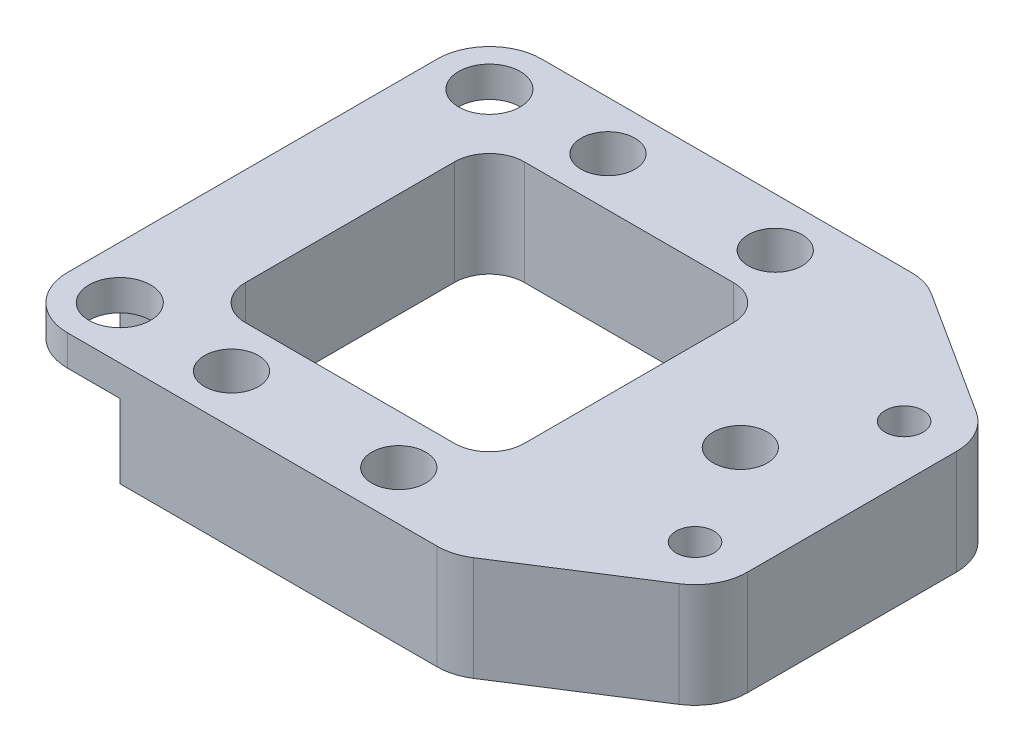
ISO-10303-21;
HEADER;
FILE_DESCRIPTION(('STEP AP214'),'2;1');
FILE_NAME('part.step','',(''),(''),'','','');
FILE_SCHEMA(('AUTOMOTIVE_DESIGN { 1 0 10303 214 1 1 1 1 }'));
ENDSEC;
DATA;
#1=APPLICATION_CONTEXT('core data for automotive mechanical design processes');
#2=APPLICATION_PROTOCOL_DEFINITION('international standard','automotive_design',2000,#1);
#3=PRODUCT_CONTEXT('',#1,'mechanical');
#4=PRODUCT('Part','Part','',(#3));
#5=PRODUCT_RELATED_PRODUCT_CATEGORY('part','',(#4));
#6=PRODUCT_DEFINITION_FORMATION('','',#4);
#7=PRODUCT_DEFINITION_CONTEXT('part definition',#1,'design');
#8=PRODUCT_DEFINITION('design','',#6,#7);
#9=PRODUCT_DEFINITION_SHAPE('','',#8);
#10=(LENGTH_UNIT() NAMED_UNIT(*) SI_UNIT(.MILLI.,.METRE.));
#11=(NAMED_UNIT(*) PLANE_ANGLE_UNIT() SI_UNIT($,.RADIAN.));
#12=(NAMED_UNIT(*) SI_UNIT($,.STERADIAN.) SOLID_ANGLE_UNIT());
#13=UNCERTAINTY_MEASURE_WITH_UNIT(LENGTH_MEASURE(1.E-05),#10,'distance_accuracy_value','');
#14=(GEOMETRIC_REPRESENTATION_CONTEXT(3) GLOBAL_UNCERTAINTY_ASSIGNED_CONTEXT((#13)) GLOBAL_UNIT_ASSIGNED_CONTEXT((#10,
#11,#12)) REPRESENTATION_CONTEXT('',''));
#15=CARTESIAN_POINT('',(0.,0.,0.));
#16=DIRECTION('',(0.,0.,1.));
#17=DIRECTION('',(1.,0.,0.));
#18=AXIS2_PLACEMENT_3D('',#15,#16,#17);
#19=CARTESIAN_POINT('',(-16.8402,0.,16.8402));
#20=DIRECTION('',(0.,-1.,0.));
#21=DIRECTION('',(0.,0.,-1.));
#22=AXIS2_PLACEMENT_3D('',#19,#20,#21);
#23=CYLINDRICAL_SURFACE('',#22,4.7625);
#24=DIRECTION('',(0.,-1.,0.));
#25=VECTOR('',#24,1.);
#26=CARTESIAN_POINT('',(-16.8401999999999,20.2013841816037,12.0777));
#27=LINE('',#26,#25);
#28=CARTESIAN_POINT('',(-16.8401999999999,6.731,12.0777));
#29=VERTEX_POINT('',#28);
#30=CARTESIAN_POINT('',(-16.8402,0.,12.0777));
#31=VERTEX_POINT('',#30);
#32=EDGE_CURVE('E370',#29,#31,#27,.T.);
#33=ORIENTED_EDGE('',*,*,#32,.T.);
#34=CARTESIAN_POINT('',(-16.8402,0.,16.8402));
#35=DIRECTION('',(0.,-1.,0.));
#36=DIRECTION('',(0.,0.,-1.));
#37=AXIS2_PLACEMENT_3D('',#34,#35,#36);
#38=CIRCLE('',#37,4.7625);
#39=CARTESIAN_POINT('',(-12.0777,0.,16.8402));
#40=VERTEX_POINT('',#39);
#41=EDGE_CURVE('E52',#31,#40,#38,.T.);
#42=ORIENTED_EDGE('',*,*,#41,.T.);
#43=DIRECTION('',(0.,-1.,0.));
#44=VECTOR('',#43,1.);
#45=CARTESIAN_POINT('',(-12.0777,20.2013841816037,16.8402));
#46=LINE('',#45,#44);
#47=CARTESIAN_POINT('',(-12.0777,6.731,16.8402));
#48=VERTEX_POINT('',#47);
#49=EDGE_CURVE('E366',#48,#40,#46,.T.);
#50=ORIENTED_EDGE('',*,*,#49,.F.);
#51=CARTESIAN_POINT('',(-16.8402,6.731,16.8402));
#52=DIRECTION('',(0.,-1.,0.));
#53=DIRECTION('',(0.,0.,-1.));
#54=AXIS2_PLACEMENT_3D('',#51,#52,#53);
#55=CIRCLE('',#54,4.7625);
#56=EDGE_CURVE('E412',#29,#48,#55,.T.);
#57=ORIENTED_EDGE('',*,*,#56,.F.);
#58=EDGE_LOOP('',(#33,#42,#50,#57));
#59=FACE_BOUND('',#58,.T.);
#60=ADVANCED_FACE('F43',(#59),#23,.F.);
#61=CARTESIAN_POINT('',(-16.8402,0.,-16.8402));
#62=DIRECTION('',(0.,-1.,0.));
#63=DIRECTION('',(0.,0.,-1.));
#64=AXIS2_PLACEMENT_3D('',#61,#62,#63);
#65=CYLINDRICAL_SURFACE('',#64,4.7625);
#66=DIRECTION('',(0.,-1.,0.));
#67=VECTOR('',#66,1.);
#68=CARTESIAN_POINT('',(-12.0777,20.2013841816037,-16.8402));
#69=LINE('',#68,#67);
#70=CARTESIAN_POINT('',(-12.0777,6.731,-16.8402));
#71=VERTEX_POINT('',#70);
#72=CARTESIAN_POINT('',(-12.0777,0.,-16.8402));
#73=VERTEX_POINT('',#72);
#74=EDGE_CURVE('E396',#71,#73,#69,.T.);
#75=ORIENTED_EDGE('',*,*,#74,.T.);
#76=CARTESIAN_POINT('',(-16.8402,0.,-16.8402));
#77=DIRECTION('',(0.,-1.,0.));
#78=DIRECTION('',(0.,0.,-1.));
#79=AXIS2_PLACEMENT_3D('',#76,#77,#78);
#80=CIRCLE('',#79,4.7625);
#81=CARTESIAN_POINT('',(-16.8402,0.,-12.0777));
#82=VERTEX_POINT('',#81);
#83=EDGE_CURVE('E360',#73,#82,#80,.T.);
#84=ORIENTED_EDGE('',*,*,#83,.T.);
#85=DIRECTION('',(0.,-1.,0.));
#86=VECTOR('',#85,1.);
#87=CARTESIAN_POINT('',(-16.8402,20.2013841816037,-12.0777));
#88=LINE('',#87,#86);
#89=CARTESIAN_POINT('',(-16.8402,6.731,-12.0777));
#90=VERTEX_POINT('',#89);
#91=EDGE_CURVE('E392',#90,#82,#88,.T.);
#92=ORIENTED_EDGE('',*,*,#91,.F.);
#93=CARTESIAN_POINT('',(-16.8402,6.731,-16.8402));
#94=DIRECTION('',(0.,-1.,0.));
#95=DIRECTION('',(0.,0.,-1.));
#96=AXIS2_PLACEMENT_3D('',#93,#94,#95);
#97=CIRCLE('',#96,4.7625);
#98=EDGE_CURVE('E54',#71,#90,#97,.T.);
#99=ORIENTED_EDGE('',*,*,#98,.F.);
#100=EDGE_LOOP('',(#75,#84,#92,#99));
#101=FACE_BOUND('',#100,.T.);
#102=ADVANCED_FACE('F630',(#101),#65,.F.);
#103=CARTESIAN_POINT('',(16.8402,0.,16.8402));
#104=DIRECTION('',(0.,1.,0.));
#105=DIRECTION('',(0.,0.,1.));
#106=AXIS2_PLACEMENT_3D('',#103,#104,#105);
#107=PLANE('',#106);
#108=CARTESIAN_POINT('',(28.2575,0.,9.525));
#109=DIRECTION('',(0.,-1.,0.));
#110=DIRECTION('',(0.,0.,-1.));
#111=AXIS2_PLACEMENT_3D('',#108,#109,#110);
#112=CIRCLE('',#111,1.7272);
#113=CARTESIAN_POINT('',(28.2575,0.,7.7978));
#114=VERTEX_POINT('',#113);
#115=EDGE_CURVE('E621',#114,#114,#112,.T.);
#116=ORIENTED_EDGE('',*,*,#115,.F.);
#117=EDGE_LOOP('',(#116));
#118=FACE_BOUND('',#117,.T.);
#119=CARTESIAN_POINT('',(28.2575,0.,-9.525));
#120=DIRECTION('',(0.,-1.,0.));
#121=DIRECTION('',(0.,0.,-1.));
#122=AXIS2_PLACEMENT_3D('',#119,#120,#121);
#123=CIRCLE('',#122,1.7272);
#124=CARTESIAN_POINT('',(28.2575,0.,-11.2522));
#125=VERTEX_POINT('',#124);
#126=EDGE_CURVE('E615',#125,#125,#123,.T.);
#127=ORIENTED_EDGE('',*,*,#126,.F.);
#128=EDGE_LOOP('',(#127));
#129=FACE_BOUND('',#128,.T.);
#130=CARTESIAN_POINT('',(8.89,0.,17.15135));
#131=DIRECTION('',(0.,-1.,0.));
#132=DIRECTION('',(0.,0.,-1.));
#133=AXIS2_PLACEMENT_3D('',#130,#131,#132);
#134=CIRCLE('',#133,2.45745);
#135=CARTESIAN_POINT('',(8.89,0.,14.6939));
#136=VERTEX_POINT('',#135);
#137=EDGE_CURVE('E607',#136,#136,#134,.T.);
#138=ORIENTED_EDGE('',*,*,#137,.F.);
#139=EDGE_LOOP('',(#138));
#140=FACE_BOUND('',#139,.T.);
#141=CARTESIAN_POINT('',(8.89,0.,-17.15135));
#142=DIRECTION('',(0.,-1.,0.));
#143=DIRECTION('',(0.,0.,-1.));
#144=AXIS2_PLACEMENT_3D('',#141,#142,#143);
#145=CIRCLE('',#144,2.45745);
#146=CARTESIAN_POINT('',(8.89,0.,-19.6088));
#147=VERTEX_POINT('',#146);
#148=EDGE_CURVE('E577',#147,#147,#145,.T.);
#149=ORIENTED_EDGE('',*,*,#148,.F.);
#150=EDGE_LOOP('',(#149));
#151=FACE_BOUND('',#150,.T.);
#152=CARTESIAN_POINT('',(22.86,0.,0.));
#153=DIRECTION('',(0.,-1.,0.));
#154=DIRECTION('',(0.,0.,-1.));
#155=AXIS2_PLACEMENT_3D('',#152,#153,#154);
#156=CIRCLE('',#155,2.45745);
#157=CARTESIAN_POINT('',(22.86,0.,-2.45745));
#158=VERTEX_POINT('',#157);
#159=EDGE_CURVE('E576',#158,#158,#156,.T.);
#160=ORIENTED_EDGE('',*,*,#159,.F.);
#161=EDGE_LOOP('',(#160));
#162=FACE_BOUND('',#161,.T.);
#163=CARTESIAN_POINT('',(-6.35,0.,-17.15135));
#164=DIRECTION('',(0.,-1.,0.));
#165=DIRECTION('',(0.,0.,-1.));
#166=AXIS2_PLACEMENT_3D('',#163,#164,#165);
#167=CIRCLE('',#166,2.45745);
#168=CARTESIAN_POINT('',(-6.35,0.,-19.6088));
#169=VERTEX_POINT('',#168);
#170=EDGE_CURVE('E583',#169,#169,#167,.T.);
#171=ORIENTED_EDGE('',*,*,#170,.F.);
#172=EDGE_LOOP('',(#171));
#173=FACE_BOUND('',#172,.T.);
#174=CARTESIAN_POINT('',(-6.35,0.,17.15135));
#175=DIRECTION('',(0.,-1.,0.));
#176=DIRECTION('',(0.,0.,-1.));
#177=AXIS2_PLACEMENT_3D('',#174,#175,#176);
#178=CIRCLE('',#177,2.45745);
#179=CARTESIAN_POINT('',(-6.35,0.,14.6939));
#180=VERTEX_POINT('',#179);
#181=EDGE_CURVE('E582',#180,#180,#178,.T.);
#182=ORIENTED_EDGE('',*,*,#181,.F.);
#183=EDGE_LOOP('',(#182));
#184=FACE_BOUND('',#183,.T.);
#185=DIRECTION('',(-1.,0.,0.));
#186=VECTOR('',#185,1.);
#187=CARTESIAN_POINT('',(9.52499999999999,0.,12.7));
#188=LINE('',#187,#186);
#189=CARTESIAN_POINT('',(9.52499999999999,0.,12.7));
#190=VERTEX_POINT('',#189);
#191=CARTESIAN_POINT('',(-9.525,0.,12.7));
#192=VERTEX_POINT('',#191);
#193=EDGE_CURVE('E308',#190,#192,#188,.T.);
#194=ORIENTED_EDGE('',*,*,#193,.F.);
#195=CARTESIAN_POINT('',(9.525,0.,9.525));
#196=DIRECTION('',(0.,-1.,0.));
#197=DIRECTION('',(0.,0.,1.));
#198=AXIS2_PLACEMENT_3D('',#195,#196,#197);
#199=CIRCLE('',#198,3.175);
#200=CARTESIAN_POINT('',(12.7,0.,9.525));
#201=VERTEX_POINT('',#200);
#202=EDGE_CURVE('E64',#201,#190,#199,.T.);
#203=ORIENTED_EDGE('',*,*,#202,.F.);
#204=DIRECTION('',(0.,0.,1.));
#205=VECTOR('',#204,1.);
#206=CARTESIAN_POINT('',(12.7,0.,-9.525));
#207=LINE('',#206,#205);
#208=CARTESIAN_POINT('',(12.7,0.,-9.525));
#209=VERTEX_POINT('',#208);
#210=EDGE_CURVE('E278',#209,#201,#207,.T.);
#211=ORIENTED_EDGE('',*,*,#210,.F.);
#212=CARTESIAN_POINT('',(9.525,0.,-9.525));
#213=DIRECTION('',(0.,-1.,0.));
#214=DIRECTION('',(0.,0.,-1.));
#215=AXIS2_PLACEMENT_3D('',#212,#213,#214);
#216=CIRCLE('',#215,3.175);
#217=CARTESIAN_POINT('',(9.525,0.,-12.7));
#218=VERTEX_POINT('',#217);
#219=EDGE_CURVE('E283',#218,#209,#216,.T.);
#220=ORIENTED_EDGE('',*,*,#219,.F.);
#221=DIRECTION('',(1.,0.,0.));
#222=VECTOR('',#221,1.);
#223=CARTESIAN_POINT('',(-9.525,0.,-12.7));
#224=LINE('',#223,#222);
#225=CARTESIAN_POINT('',(-9.525,0.,-12.7));
#226=VERTEX_POINT('',#225);
#227=EDGE_CURVE('E321',#226,#218,#224,.T.);
#228=ORIENTED_EDGE('',*,*,#227,.F.);
#229=CARTESIAN_POINT('',(-9.525,0.,-9.52500000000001));
#230=DIRECTION('',(0.,-1.,0.));
#231=DIRECTION('',(0.,0.,-1.));
#232=AXIS2_PLACEMENT_3D('',#229,#230,#231);
#233=CIRCLE('',#232,3.175);
#234=CARTESIAN_POINT('',(-12.7,0.,-9.52500000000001));
#235=VERTEX_POINT('',#234);
#236=EDGE_CURVE('E318',#235,#226,#233,.T.);
#237=ORIENTED_EDGE('',*,*,#236,.F.);
#238=DIRECTION('',(0.,0.,-1.));
#239=VECTOR('',#238,1.);
#240=CARTESIAN_POINT('',(-12.7,0.,9.525));
#241=LINE('',#240,#239);
#242=CARTESIAN_POINT('',(-12.7,0.,9.525));
#243=VERTEX_POINT('',#242);
#244=EDGE_CURVE('E315',#243,#235,#241,.T.);
#245=ORIENTED_EDGE('',*,*,#244,.F.);
#246=CARTESIAN_POINT('',(-9.525,0.,9.525));
#247=DIRECTION('',(0.,-1.,0.));
#248=DIRECTION('',(0.,0.,-1.));
#249=AXIS2_PLACEMENT_3D('',#246,#247,#248);
#250=CIRCLE('',#249,3.175);
#251=EDGE_CURVE('E311',#192,#243,#250,.T.);
#252=ORIENTED_EDGE('',*,*,#251,.F.);
#253=EDGE_LOOP('',(#194,#203,#211,#220,#228,#237,#245,#252));
#254=FACE_BOUND('',#253,.T.);
#255=ORIENTED_EDGE('',*,*,#41,.F.);
#256=DIRECTION('',(1.,0.,0.));
#257=VECTOR('',#256,1.);
#258=CARTESIAN_POINT('',(-16.8401999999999,0.,12.0777));
#259=LINE('',#258,#257);
#260=CARTESIAN_POINT('',(-21.6027,0.,12.0777));
#261=VERTEX_POINT('',#260);
#262=EDGE_CURVE('E349',#261,#31,#259,.T.);
#263=ORIENTED_EDGE('',*,*,#262,.F.);
#264=DIRECTION('',(0.,0.,1.));
#265=VECTOR('',#264,1.);
#266=CARTESIAN_POINT('',(-21.6027,0.,16.8402));
#267=LINE('',#266,#265);
#268=CARTESIAN_POINT('',(-21.6027,0.,-12.0777));
#269=VERTEX_POINT('',#268);
#270=EDGE_CURVE('E487',#269,#261,#267,.T.);
#271=ORIENTED_EDGE('',*,*,#270,.F.);
#272=DIRECTION('',(-1.,0.,0.));
#273=VECTOR('',#272,1.);
#274=CARTESIAN_POINT('',(-16.8402,0.,-12.0777));
#275=LINE('',#274,#273);
#276=EDGE_CURVE('E380',#82,#269,#275,.T.);
#277=ORIENTED_EDGE('',*,*,#276,.F.);
#278=ORIENTED_EDGE('',*,*,#83,.F.);
#279=DIRECTION('',(0.,0.,1.));
#280=VECTOR('',#279,1.);
#281=CARTESIAN_POINT('',(-12.0777,0.,-16.8402));
#282=LINE('',#281,#280);
#283=CARTESIAN_POINT('',(-12.0777,0.,-21.6027));
#284=VERTEX_POINT('',#283);
#285=EDGE_CURVE('E329',#284,#73,#282,.T.);
#286=ORIENTED_EDGE('',*,*,#285,.F.);
#287=DIRECTION('',(-1.,0.,0.));
#288=VECTOR('',#287,1.);
#289=CARTESIAN_POINT('',(16.8402,0.,-21.6027));
#290=LINE('',#289,#288);
#291=CARTESIAN_POINT('',(16.8402,0.,-21.6027));
#292=VERTEX_POINT('',#291);
#293=EDGE_CURVE('E483',#292,#284,#290,.T.);
#294=ORIENTED_EDGE('',*,*,#293,.F.);
#295=CARTESIAN_POINT('',(16.8402,0.,-16.8402000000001));
#296=DIRECTION('',(0.,1.,0.));
#297=DIRECTION('',(0.,0.,-1.));
#298=AXIS2_PLACEMENT_3D('',#295,#296,#297);
#299=CIRCLE('',#298,4.76249999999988);
#300=CARTESIAN_POINT('',(19.4094681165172,0.,-20.8502208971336));
#301=VERTEX_POINT('',#300);
#302=EDGE_CURVE('E480',#301,#292,#299,.T.);
#303=ORIENTED_EDGE('',*,*,#302,.F.);
#304=DIRECTION('',(-0.841999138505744,0.,-0.539478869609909));
#305=VECTOR('',#304,1.);
#306=CARTESIAN_POINT('',(19.4094681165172,0.,-20.8502208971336));
#307=LINE('',#306,#305);
#308=CARTESIAN_POINT('',(30.8267681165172,0.,-13.5350208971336));
#309=VERTEX_POINT('',#308);
#310=EDGE_CURVE('E477',#309,#301,#307,.T.);
#311=ORIENTED_EDGE('',*,*,#310,.F.);
#312=CARTESIAN_POINT('',(28.2575,0.,-9.525));
#313=DIRECTION('',(0.,1.,0.));
#314=DIRECTION('',(0.,0.,-1.));
#315=AXIS2_PLACEMENT_3D('',#312,#313,#314);
#316=CIRCLE('',#315,4.7625);
#317=CARTESIAN_POINT('',(33.02,0.,-9.525));
#318=VERTEX_POINT('',#317);
#319=EDGE_CURVE('E474',#318,#309,#316,.T.);
#320=ORIENTED_EDGE('',*,*,#319,.F.);
#321=DIRECTION('',(0.,0.,-1.));
#322=VECTOR('',#321,1.);
#323=CARTESIAN_POINT('',(33.02,0.,9.525));
#324=LINE('',#323,#322);
#325=CARTESIAN_POINT('',(33.02,0.,9.525));
#326=VERTEX_POINT('',#325);
#327=EDGE_CURVE('E472',#326,#318,#324,.T.);
#328=ORIENTED_EDGE('',*,*,#327,.F.);
#329=CARTESIAN_POINT('',(28.2575,0.,9.525));
#330=DIRECTION('',(0.,1.,0.));
#331=DIRECTION('',(0.,0.,1.));
#332=AXIS2_PLACEMENT_3D('',#329,#330,#331);
#333=CIRCLE('',#332,4.7625);
#334=CARTESIAN_POINT('',(30.8267681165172,0.,13.5350208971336));
#335=VERTEX_POINT('',#334);
#336=EDGE_CURVE('E470',#335,#326,#333,.T.);
#337=ORIENTED_EDGE('',*,*,#336,.F.);
#338=DIRECTION('',(0.841999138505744,0.,-0.539478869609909));
#339=VECTOR('',#338,1.);
#340=CARTESIAN_POINT('',(19.4094681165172,0.,20.8502208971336));
#341=LINE('',#340,#339);
#342=CARTESIAN_POINT('',(19.4094681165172,0.,20.8502208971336));
#343=VERTEX_POINT('',#342);
#344=EDGE_CURVE('E467',#343,#335,#341,.T.);
#345=ORIENTED_EDGE('',*,*,#344,.F.);
#346=CARTESIAN_POINT('',(16.8402,0.,16.8402));
#347=DIRECTION('',(0.,1.,0.));
#348=DIRECTION('',(0.,0.,1.));
#349=AXIS2_PLACEMENT_3D('',#346,#347,#348);
#350=CIRCLE('',#349,4.76250000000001);
#351=CARTESIAN_POINT('',(16.8402,0.,21.6027));
#352=VERTEX_POINT('',#351);
#353=EDGE_CURVE('E428',#352,#343,#350,.T.);
#354=ORIENTED_EDGE('',*,*,#353,.F.);
#355=DIRECTION('',(1.,0.,0.));
#356=VECTOR('',#355,1.);
#357=CARTESIAN_POINT('',(16.8402,0.,21.6027));
#358=LINE('',#357,#356);
#359=CARTESIAN_POINT('',(-12.0777,0.,21.6027));
#360=VERTEX_POINT('',#359);
#361=EDGE_CURVE('E434',#360,#352,#358,.T.);
#362=ORIENTED_EDGE('',*,*,#361,.F.);
#363=DIRECTION('',(0.,0.,1.));
#364=VECTOR('',#363,1.);
#365=CARTESIAN_POINT('',(-12.0777,0.,16.8402));
#366=LINE('',#365,#364);
#367=EDGE_CURVE('E345',#40,#360,#366,.T.);
#368=ORIENTED_EDGE('',*,*,#367,.F.);
#369=EDGE_LOOP('',(#255,#263,#271,#277,#278,#286,#294,#303,#311,#320,#328,#337,#345,#354,#362,#368));
#370=FACE_BOUND('',#369,.T.);
#371=ADVANCED_FACE('F544',(#118,#129,#140,#151,#162,#173,#184,#254,#370),#107,.F.);
#372=CARTESIAN_POINT('',(-16.8402,9.525,-16.8402));
#373=DIRECTION('',(0.,-1.,0.));
#374=DIRECTION('',(0.,0.,-1.));
#375=AXIS2_PLACEMENT_3D('',#372,#373,#374);
#376=CYLINDRICAL_SURFACE('',#375,4.7625);
#377=CARTESIAN_POINT('',(-21.6027,6.731,-16.8402));
#378=VERTEX_POINT('',#377);
#379=CARTESIAN_POINT('',(-16.8402,6.731,-21.6027));
#380=VERTEX_POINT('',#379);
#381=EDGE_CURVE('E11',#378,#380,#97,.T.);
#382=ORIENTED_EDGE('',*,*,#381,.F.);
#383=DIRECTION('',(0.,-1.,0.));
#384=VECTOR('',#383,1.);
#385=CARTESIAN_POINT('',(-21.6027,9.525,-16.8402));
#386=LINE('',#385,#384);
#387=CARTESIAN_POINT('',(-21.6027,9.525,-16.8402));
#388=VERTEX_POINT('',#387);
#389=EDGE_CURVE('E503',#388,#378,#386,.T.);
#390=ORIENTED_EDGE('',*,*,#389,.F.);
#391=CARTESIAN_POINT('',(-16.8402,9.525,-16.8402));
#392=DIRECTION('',(0.,1.,0.));
#393=DIRECTION('',(0.,0.,1.));
#394=AXIS2_PLACEMENT_3D('',#391,#392,#393);
#395=CIRCLE('',#394,4.7625);
#396=CARTESIAN_POINT('',(-16.8402,9.525,-21.6027));
#397=VERTEX_POINT('',#396);
#398=EDGE_CURVE('E452',#397,#388,#395,.T.);
#399=ORIENTED_EDGE('',*,*,#398,.F.);
#400=DIRECTION('',(0.,-1.,0.));
#401=VECTOR('',#400,1.);
#402=CARTESIAN_POINT('',(-16.8402,9.525,-21.6027));
#403=LINE('',#402,#401);
#404=EDGE_CURVE('E506',#397,#380,#403,.T.);
#405=ORIENTED_EDGE('',*,*,#404,.T.);
#406=EDGE_LOOP('',(#382,#390,#399,#405));
#407=FACE_BOUND('',#406,.T.);
#408=ADVANCED_FACE('F629',(#407),#376,.T.);
#409=CARTESIAN_POINT('',(-16.8402,9.525,16.8402));
#410=DIRECTION('',(0.,-1.,0.));
#411=DIRECTION('',(0.,0.,-1.));
#412=AXIS2_PLACEMENT_3D('',#409,#410,#411);
#413=CYLINDRICAL_SURFACE('',#412,4.7625);
#414=CARTESIAN_POINT('',(-16.8402,6.731,21.6027));
#415=VERTEX_POINT('',#414);
#416=CARTESIAN_POINT('',(-21.6027,6.731,16.8402));
#417=VERTEX_POINT('',#416);
#418=EDGE_CURVE('E416',#415,#417,#55,.T.);
#419=ORIENTED_EDGE('',*,*,#418,.F.);
#420=DIRECTION('',(0.,-1.,0.));
#421=VECTOR('',#420,1.);
#422=CARTESIAN_POINT('',(-16.8402,9.525,21.6027));
#423=LINE('',#422,#421);
#424=CARTESIAN_POINT('',(-16.8402,9.525,21.6027));
#425=VERTEX_POINT('',#424);
#426=EDGE_CURVE('E495',#425,#415,#423,.T.);
#427=ORIENTED_EDGE('',*,*,#426,.F.);
#428=CARTESIAN_POINT('',(-16.8402,9.525,16.8402));
#429=DIRECTION('',(0.,1.,0.));
#430=DIRECTION('',(0.,0.,-1.));
#431=AXIS2_PLACEMENT_3D('',#428,#429,#430);
#432=CIRCLE('',#431,4.7625);
#433=CARTESIAN_POINT('',(-21.6027,9.525,16.8402));
#434=VERTEX_POINT('',#433);
#435=EDGE_CURVE('E457',#434,#425,#432,.T.);
#436=ORIENTED_EDGE('',*,*,#435,.F.);
#437=DIRECTION('',(0.,-1.,0.));
#438=VECTOR('',#437,1.);
#439=CARTESIAN_POINT('',(-21.6027,9.525,16.8402));
#440=LINE('',#439,#438);
#441=EDGE_CURVE('E499',#434,#417,#440,.T.);
#442=ORIENTED_EDGE('',*,*,#441,.T.);
#443=EDGE_LOOP('',(#419,#427,#436,#442));
#444=FACE_BOUND('',#443,.T.);
#445=ADVANCED_FACE('F698',(#444),#413,.T.);
#446=CARTESIAN_POINT('',(16.8402,9.525,16.8402));
#447=DIRECTION('',(0.,-1.,0.));
#448=DIRECTION('',(0.,0.,-1.));
#449=AXIS2_PLACEMENT_3D('',#446,#447,#448);
#450=CYLINDRICAL_SURFACE('',#449,4.76250000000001);
#451=ORIENTED_EDGE('',*,*,#353,.T.);
#452=DIRECTION('',(0.,-1.,0.));
#453=VECTOR('',#452,1.);
#454=CARTESIAN_POINT('',(19.4094681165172,9.525,20.8502208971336));
#455=LINE('',#454,#453);
#456=CARTESIAN_POINT('',(19.4094681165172,9.525,20.8502208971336));
#457=VERTEX_POINT('',#456);
#458=EDGE_CURVE('E47',#457,#343,#455,.T.);
#459=ORIENTED_EDGE('',*,*,#458,.F.);
#460=CARTESIAN_POINT('',(16.8402,9.525,16.8402));
#461=DIRECTION('',(0.,1.,0.));
#462=DIRECTION('',(0.,0.,1.));
#463=AXIS2_PLACEMENT_3D('',#460,#461,#462);
#464=CIRCLE('',#463,4.76250000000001);
#465=CARTESIAN_POINT('',(16.8402,9.525,21.6027));
#466=VERTEX_POINT('',#465);
#467=EDGE_CURVE('E429',#466,#457,#464,.T.);
#468=ORIENTED_EDGE('',*,*,#467,.F.);
#469=DIRECTION('',(0.,-1.,0.));
#470=VECTOR('',#469,1.);
#471=CARTESIAN_POINT('',(16.8402,9.525,21.6027));
#472=LINE('',#471,#470);
#473=EDGE_CURVE('E463',#466,#352,#472,.T.);
#474=ORIENTED_EDGE('',*,*,#473,.T.);
#475=EDGE_LOOP('',(#451,#459,#468,#474));
#476=FACE_BOUND('',#475,.T.);
#477=ADVANCED_FACE('F45',(#476),#450,.T.);
#478=CARTESIAN_POINT('',(19.4094681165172,9.525,20.8502208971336));
#479=DIRECTION('',(-0.539478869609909,0.,-0.841999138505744));
#480=DIRECTION('',(-0.841999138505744,0.,0.539478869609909));
#481=AXIS2_PLACEMENT_3D('',#478,#479,#480);
#482=PLANE('',#481);
#483=ORIENTED_EDGE('',*,*,#344,.T.);
#484=DIRECTION('',(0.,-1.,0.));
#485=VECTOR('',#484,1.);
#486=CARTESIAN_POINT('',(30.8267681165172,9.525,13.5350208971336));
#487=LINE('',#486,#485);
#488=CARTESIAN_POINT('',(30.8267681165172,9.525,13.5350208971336));
#489=VERTEX_POINT('',#488);
#490=EDGE_CURVE('E526',#489,#335,#487,.T.);
#491=ORIENTED_EDGE('',*,*,#490,.F.);
#492=DIRECTION('',(0.841999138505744,0.,-0.539478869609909));
#493=VECTOR('',#492,1.);
#494=CARTESIAN_POINT('',(19.4094681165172,9.525,20.8502208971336));
#495=LINE('',#494,#493);
#496=EDGE_CURVE('E433',#457,#489,#495,.T.);
#497=ORIENTED_EDGE('',*,*,#496,.F.);
#498=ORIENTED_EDGE('',*,*,#458,.T.);
#499=EDGE_LOOP('',(#483,#491,#497,#498));
#500=FACE_BOUND('',#499,.T.);
#501=ADVANCED_FACE('F536',(#500),#482,.F.);
#502=CARTESIAN_POINT('',(28.2575,9.525,9.525));
#503=DIRECTION('',(0.,-1.,0.));
#504=DIRECTION('',(0.,0.,-1.));
#505=AXIS2_PLACEMENT_3D('',#502,#503,#504);
#506=CYLINDRICAL_SURFACE('',#505,4.7625);
#507=ORIENTED_EDGE('',*,*,#336,.T.);
#508=DIRECTION('',(0.,-1.,0.));
#509=VECTOR('',#508,1.);
#510=CARTESIAN_POINT('',(33.02,9.525,9.525));
#511=LINE('',#510,#509);
#512=CARTESIAN_POINT('',(33.02,9.525,9.525));
#513=VERTEX_POINT('',#512);
#514=EDGE_CURVE('E524',#513,#326,#511,.T.);
#515=ORIENTED_EDGE('',*,*,#514,.F.);
#516=CARTESIAN_POINT('',(28.2575,9.525,9.525));
#517=DIRECTION('',(0.,1.,0.));
#518=DIRECTION('',(0.,0.,1.));
#519=AXIS2_PLACEMENT_3D('',#516,#517,#518);
#520=CIRCLE('',#519,4.7625);
#521=EDGE_CURVE('E436',#489,#513,#520,.T.);
#522=ORIENTED_EDGE('',*,*,#521,.F.);
#523=ORIENTED_EDGE('',*,*,#490,.T.);
#524=EDGE_LOOP('',(#507,#515,#522,#523));
#525=FACE_BOUND('',#524,.T.);
#526=ADVANCED_FACE('F549',(#525),#506,.T.);
#527=CARTESIAN_POINT('',(33.02,9.525,9.525));
#528=DIRECTION('',(-1.,0.,0.));
#529=DIRECTION('',(0.,0.,1.));
#530=AXIS2_PLACEMENT_3D('',#527,#528,#529);
#531=PLANE('',#530);
#532=ORIENTED_EDGE('',*,*,#327,.T.);
#533=DIRECTION('',(0.,-1.,0.));
#534=VECTOR('',#533,1.);
#535=CARTESIAN_POINT('',(33.02,9.525,-9.525));
#536=LINE('',#535,#534);
#537=CARTESIAN_POINT('',(33.02,9.525,-9.525));
#538=VERTEX_POINT('',#537);
#539=EDGE_CURVE('E520',#538,#318,#536,.T.);
#540=ORIENTED_EDGE('',*,*,#539,.F.);
#541=DIRECTION('',(0.,0.,-1.));
#542=VECTOR('',#541,1.);
#543=CARTESIAN_POINT('',(33.02,9.525,9.525));
#544=LINE('',#543,#542);
#545=EDGE_CURVE('E438',#513,#538,#544,.T.);
#546=ORIENTED_EDGE('',*,*,#545,.F.);
#547=ORIENTED_EDGE('',*,*,#514,.T.);
#548=EDGE_LOOP('',(#532,#540,#546,#547));
#549=FACE_BOUND('',#548,.T.);
#550=ADVANCED_FACE('F552',(#549),#531,.F.);
#551=CARTESIAN_POINT('',(28.2575,9.525,-9.525));
#552=DIRECTION('',(0.,-1.,0.));
#553=DIRECTION('',(0.,0.,-1.));
#554=AXIS2_PLACEMENT_3D('',#551,#552,#553);
#555=CYLINDRICAL_SURFACE('',#554,4.7625);
#556=ORIENTED_EDGE('',*,*,#319,.T.);
#557=DIRECTION('',(0.,-1.,0.));
#558=VECTOR('',#557,1.);
#559=CARTESIAN_POINT('',(30.8267681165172,9.525,-13.5350208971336));
#560=LINE('',#559,#558);
#561=CARTESIAN_POINT('',(30.8267681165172,9.525,-13.5350208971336));
#562=VERTEX_POINT('',#561);
#563=EDGE_CURVE('E516',#562,#309,#560,.T.);
#564=ORIENTED_EDGE('',*,*,#563,.F.);
#565=CARTESIAN_POINT('',(28.2575,9.525,-9.525));
#566=DIRECTION('',(0.,1.,0.));
#567=DIRECTION('',(0.,0.,-1.));
#568=AXIS2_PLACEMENT_3D('',#565,#566,#567);
#569=CIRCLE('',#568,4.7625);
#570=EDGE_CURVE('E441',#538,#562,#569,.T.);
#571=ORIENTED_EDGE('',*,*,#570,.F.);
#572=ORIENTED_EDGE('',*,*,#539,.T.);
#573=EDGE_LOOP('',(#556,#564,#571,#572));
#574=FACE_BOUND('',#573,.T.);
#575=ADVANCED_FACE('F719',(#574),#555,.T.);
#576=CARTESIAN_POINT('',(19.4094681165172,9.525,-20.8502208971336));
#577=DIRECTION('',(-0.539478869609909,0.,0.841999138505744));
#578=DIRECTION('',(0.841999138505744,0.,0.539478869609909));
#579=AXIS2_PLACEMENT_3D('',#576,#577,#578);
#580=PLANE('',#579);
#581=ORIENTED_EDGE('',*,*,#310,.T.);
#582=DIRECTION('',(0.,-1.,0.));
#583=VECTOR('',#582,1.);
#584=CARTESIAN_POINT('',(19.4094681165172,9.525,-20.8502208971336));
#585=LINE('',#584,#583);
#586=CARTESIAN_POINT('',(19.4094681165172,9.525,-20.8502208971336));
#587=VERTEX_POINT('',#586);
#588=EDGE_CURVE('E513',#587,#301,#585,.T.);
#589=ORIENTED_EDGE('',*,*,#588,.F.);
#590=DIRECTION('',(-0.841999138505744,0.,-0.539478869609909));
#591=VECTOR('',#590,1.);
#592=CARTESIAN_POINT('',(19.4094681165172,9.525,-20.8502208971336));
#593=LINE('',#592,#591);
#594=EDGE_CURVE('E444',#562,#587,#593,.T.);
#595=ORIENTED_EDGE('',*,*,#594,.F.);
#596=ORIENTED_EDGE('',*,*,#563,.T.);
#597=EDGE_LOOP('',(#581,#589,#595,#596));
#598=FACE_BOUND('',#597,.T.);
#599=ADVANCED_FACE('F715',(#598),#580,.F.);
#600=CARTESIAN_POINT('',(16.8402,9.525,-16.8402000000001));
#601=DIRECTION('',(0.,-1.,0.));
#602=DIRECTION('',(0.,0.,-1.));
#603=AXIS2_PLACEMENT_3D('',#600,#601,#602);
#604=CYLINDRICAL_SURFACE('',#603,4.76249999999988);
#605=ORIENTED_EDGE('',*,*,#302,.T.);
#606=DIRECTION('',(0.,-1.,0.));
#607=VECTOR('',#606,1.);
#608=CARTESIAN_POINT('',(16.8402,9.525,-21.6027));
#609=LINE('',#608,#607);
#610=CARTESIAN_POINT('',(16.8402,9.525,-21.6027));
#611=VERTEX_POINT('',#610);
#612=EDGE_CURVE('E509',#611,#292,#609,.T.);
#613=ORIENTED_EDGE('',*,*,#612,.F.);
#614=CARTESIAN_POINT('',(16.8402,9.525,-16.8402000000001));
#615=DIRECTION('',(0.,1.,0.));
#616=DIRECTION('',(0.,0.,-1.));
#617=AXIS2_PLACEMENT_3D('',#614,#615,#616);
#618=CIRCLE('',#617,4.76249999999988);
#619=EDGE_CURVE('E447',#587,#611,#618,.T.);
#620=ORIENTED_EDGE('',*,*,#619,.F.);
#621=ORIENTED_EDGE('',*,*,#588,.T.);
#622=EDGE_LOOP('',(#605,#613,#620,#621));
#623=FACE_BOUND('',#622,.T.);
#624=ADVANCED_FACE('F711',(#623),#604,.T.);
#625=CARTESIAN_POINT('',(16.8402,9.525,-21.6027));
#626=DIRECTION('',(0.,0.,1.));
#627=DIRECTION('',(1.,0.,0.));
#628=AXIS2_PLACEMENT_3D('',#625,#626,#627);
#629=PLANE('',#628);
#630=DIRECTION('',(0.,-1.,0.));
#631=VECTOR('',#630,1.);
#632=CARTESIAN_POINT('',(-12.0777,20.2013841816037,-21.6027));
#633=LINE('',#632,#631);
#634=CARTESIAN_POINT('',(-12.0777,6.731,-21.6027));
#635=VERTEX_POINT('',#634);
#636=EDGE_CURVE('E386',#635,#284,#633,.T.);
#637=ORIENTED_EDGE('',*,*,#636,.F.);
#638=DIRECTION('',(1.,0.,0.));
#639=VECTOR('',#638,1.);
#640=CARTESIAN_POINT('',(-16.8402,6.731,-21.6027));
#641=LINE('',#640,#639);
#642=EDGE_CURVE('E382',#380,#635,#641,.T.);
#643=ORIENTED_EDGE('',*,*,#642,.F.);
#644=ORIENTED_EDGE('',*,*,#404,.F.);
#645=DIRECTION('',(-1.,0.,0.));
#646=VECTOR('',#645,1.);
#647=CARTESIAN_POINT('',(16.8402,9.525,-21.6027));
#648=LINE('',#647,#646);
#649=EDGE_CURVE('E449',#611,#397,#648,.T.);
#650=ORIENTED_EDGE('',*,*,#649,.F.);
#651=ORIENTED_EDGE('',*,*,#612,.T.);
#652=ORIENTED_EDGE('',*,*,#293,.T.);
#653=EDGE_LOOP('',(#637,#643,#644,#650,#651,#652));
#654=FACE_BOUND('',#653,.T.);
#655=ADVANCED_FACE('F704',(#654),#629,.F.);
#656=CARTESIAN_POINT('',(-21.6027,9.525,16.8402));
#657=DIRECTION('',(1.,0.,0.));
#658=DIRECTION('',(0.,0.,-1.));
#659=AXIS2_PLACEMENT_3D('',#656,#657,#658);
#660=PLANE('',#659);
#661=DIRECTION('',(0.,-1.,0.));
#662=VECTOR('',#661,1.);
#663=CARTESIAN_POINT('',(-21.6027,20.2013841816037,12.0777));
#664=LINE('',#663,#662);
#665=CARTESIAN_POINT('',(-21.6027,6.731,12.0777));
#666=VERTEX_POINT('',#665);
#667=EDGE_CURVE('E356',#666,#261,#664,.T.);
#668=ORIENTED_EDGE('',*,*,#667,.F.);
#669=DIRECTION('',(0.,0.,-1.));
#670=VECTOR('',#669,1.);
#671=CARTESIAN_POINT('',(-21.6027,6.731,16.8402));
#672=LINE('',#671,#670);
#673=EDGE_CURVE('E348',#417,#666,#672,.T.);
#674=ORIENTED_EDGE('',*,*,#673,.F.);
#675=ORIENTED_EDGE('',*,*,#441,.F.);
#676=DIRECTION('',(0.,0.,1.));
#677=VECTOR('',#676,1.);
#678=CARTESIAN_POINT('',(-21.6027,9.525,16.8402));
#679=LINE('',#678,#677);
#680=EDGE_CURVE('E454',#388,#434,#679,.T.);
#681=ORIENTED_EDGE('',*,*,#680,.F.);
#682=ORIENTED_EDGE('',*,*,#389,.T.);
#683=DIRECTION('',(0.,0.,-1.));
#684=VECTOR('',#683,1.);
#685=CARTESIAN_POINT('',(-21.6027,6.731,-12.0777));
#686=LINE('',#685,#684);
#687=CARTESIAN_POINT('',(-21.6027,6.731,-12.0777));
#688=VERTEX_POINT('',#687);
#689=EDGE_CURVE('E352',#688,#378,#686,.T.);
#690=ORIENTED_EDGE('',*,*,#689,.F.);
#691=DIRECTION('',(0.,-1.,0.));
#692=VECTOR('',#691,1.);
#693=CARTESIAN_POINT('',(-21.6027,20.2013841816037,-12.0777));
#694=LINE('',#693,#692);
#695=EDGE_CURVE('E388',#688,#269,#694,.T.);
#696=ORIENTED_EDGE('',*,*,#695,.T.);
#697=ORIENTED_EDGE('',*,*,#270,.T.);
#698=EDGE_LOOP('',(#668,#674,#675,#681,#682,#690,#696,#697));
#699=FACE_BOUND('',#698,.T.);
#700=ADVANCED_FACE('F697',(#699),#660,.F.);
#701=CARTESIAN_POINT('',(16.8402,9.525,21.6027));
#702=DIRECTION('',(0.,0.,-1.));
#703=DIRECTION('',(-1.,0.,0.));
#704=AXIS2_PLACEMENT_3D('',#701,#702,#703);
#705=PLANE('',#704);
#706=ORIENTED_EDGE('',*,*,#426,.T.);
#707=DIRECTION('',(-1.,0.,0.));
#708=VECTOR('',#707,1.);
#709=CARTESIAN_POINT('',(-12.0777,6.731,21.6027));
#710=LINE('',#709,#708);
#711=CARTESIAN_POINT('',(-12.0777,6.731,21.6027));
#712=VERTEX_POINT('',#711);
#713=EDGE_CURVE('E357',#712,#415,#710,.T.);
#714=ORIENTED_EDGE('',*,*,#713,.F.);
#715=DIRECTION('',(0.,-1.,0.));
#716=VECTOR('',#715,1.);
#717=CARTESIAN_POINT('',(-12.0777,20.2013841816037,21.6027));
#718=LINE('',#717,#716);
#719=EDGE_CURVE('E361',#712,#360,#718,.T.);
#720=ORIENTED_EDGE('',*,*,#719,.T.);
#721=ORIENTED_EDGE('',*,*,#361,.T.);
#722=ORIENTED_EDGE('',*,*,#473,.F.);
#723=DIRECTION('',(1.,0.,0.));
#724=VECTOR('',#723,1.);
#725=CARTESIAN_POINT('',(16.8402,9.525,21.6027));
#726=LINE('',#725,#724);
#727=EDGE_CURVE('E460',#425,#466,#726,.T.);
#728=ORIENTED_EDGE('',*,*,#727,.F.);
#729=EDGE_LOOP('',(#706,#714,#720,#721,#722,#728));
#730=FACE_BOUND('',#729,.T.);
#731=ADVANCED_FACE('F561',(#730),#705,.F.);
#732=CARTESIAN_POINT('',(16.8402,9.525,16.8402));
#733=DIRECTION('',(0.,1.,0.));
#734=DIRECTION('',(0.,0.,1.));
#735=AXIS2_PLACEMENT_3D('',#732,#733,#734);
#736=PLANE('',#735);
#737=CARTESIAN_POINT('',(28.2575,9.525,9.525));
#738=DIRECTION('',(0.,-1.,0.));
#739=DIRECTION('',(0.,0.,-1.));
#740=AXIS2_PLACEMENT_3D('',#737,#738,#739);
#741=CIRCLE('',#740,1.7272);
#742=CARTESIAN_POINT('',(28.2575,9.525,7.7978));
#743=VERTEX_POINT('',#742);
#744=EDGE_CURVE('E618',#743,#743,#741,.T.);
#745=ORIENTED_EDGE('',*,*,#744,.T.);
#746=EDGE_LOOP('',(#745));
#747=FACE_BOUND('',#746,.T.);
#748=CARTESIAN_POINT('',(28.2575,9.525,-9.525));
#749=DIRECTION('',(0.,-1.,0.));
#750=DIRECTION('',(0.,0.,-1.));
#751=AXIS2_PLACEMENT_3D('',#748,#749,#750);
#752=CIRCLE('',#751,1.7272);
#753=CARTESIAN_POINT('',(28.2575,9.525,-11.2522));
#754=VERTEX_POINT('',#753);
#755=EDGE_CURVE('E611',#754,#754,#752,.T.);
#756=ORIENTED_EDGE('',*,*,#755,.T.);
#757=EDGE_LOOP('',(#756));
#758=FACE_BOUND('',#757,.T.);
#759=CARTESIAN_POINT('',(8.89,9.525,17.15135));
#760=DIRECTION('',(0.,-1.,0.));
#761=DIRECTION('',(0.,0.,-1.));
#762=AXIS2_PLACEMENT_3D('',#759,#760,#761);
#763=CIRCLE('',#762,2.45745);
#764=CARTESIAN_POINT('',(8.89,9.525,14.6939));
#765=VERTEX_POINT('',#764);
#766=EDGE_CURVE('E603',#765,#765,#763,.T.);
#767=ORIENTED_EDGE('',*,*,#766,.T.);
#768=EDGE_LOOP('',(#767));
#769=FACE_BOUND('',#768,.T.);
#770=CARTESIAN_POINT('',(8.89,9.525,-17.15135));
#771=DIRECTION('',(0.,-1.,0.));
#772=DIRECTION('',(0.,0.,-1.));
#773=AXIS2_PLACEMENT_3D('',#770,#771,#772);
#774=CIRCLE('',#773,2.45745);
#775=CARTESIAN_POINT('',(8.89,9.525,-19.6088));
#776=VERTEX_POINT('',#775);
#777=EDGE_CURVE('E574',#776,#776,#774,.T.);
#778=ORIENTED_EDGE('',*,*,#777,.T.);
#779=EDGE_LOOP('',(#778));
#780=FACE_BOUND('',#779,.T.);
#781=CARTESIAN_POINT('',(22.86,9.525,0.));
#782=DIRECTION('',(0.,-1.,0.));
#783=DIRECTION('',(0.,0.,-1.));
#784=AXIS2_PLACEMENT_3D('',#781,#782,#783);
#785=CIRCLE('',#784,2.45745);
#786=CARTESIAN_POINT('',(22.86,9.525,-2.45745));
#787=VERTEX_POINT('',#786);
#788=EDGE_CURVE('E594',#787,#787,#785,.T.);
#789=ORIENTED_EDGE('',*,*,#788,.T.);
#790=EDGE_LOOP('',(#789));
#791=FACE_BOUND('',#790,.T.);
#792=CARTESIAN_POINT('',(-6.35,9.525,-17.15135));
#793=DIRECTION('',(0.,-1.,0.));
#794=DIRECTION('',(0.,0.,-1.));
#795=AXIS2_PLACEMENT_3D('',#792,#793,#794);
#796=CIRCLE('',#795,2.45745);
#797=CARTESIAN_POINT('',(-6.35,9.525,-19.6088));
#798=VERTEX_POINT('',#797);
#799=EDGE_CURVE('E580',#798,#798,#796,.T.);
#800=ORIENTED_EDGE('',*,*,#799,.T.);
#801=EDGE_LOOP('',(#800));
#802=FACE_BOUND('',#801,.T.);
#803=CARTESIAN_POINT('',(-6.35,9.525,17.15135));
#804=DIRECTION('',(0.,-1.,0.));
#805=DIRECTION('',(0.,0.,-1.));
#806=AXIS2_PLACEMENT_3D('',#803,#804,#805);
#807=CIRCLE('',#806,2.45745);
#808=CARTESIAN_POINT('',(-6.35,9.525,14.6939));
#809=VERTEX_POINT('',#808);
#810=EDGE_CURVE('E286',#809,#809,#807,.T.);
#811=ORIENTED_EDGE('',*,*,#810,.T.);
#812=EDGE_LOOP('',(#811));
#813=FACE_BOUND('',#812,.T.);
#814=CARTESIAN_POINT('',(9.525,9.525,9.525));
#815=DIRECTION('',(0.,-1.,0.));
#816=DIRECTION('',(0.,0.,1.));
#817=AXIS2_PLACEMENT_3D('',#814,#815,#816);
#818=CIRCLE('',#817,3.175);
#819=CARTESIAN_POINT('',(12.7,9.525,9.525));
#820=VERTEX_POINT('',#819);
#821=CARTESIAN_POINT('',(9.52499999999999,9.525,12.7));
#822=VERTEX_POINT('',#821);
#823=EDGE_CURVE('E258',#820,#822,#818,.T.);
#824=ORIENTED_EDGE('',*,*,#823,.T.);
#825=DIRECTION('',(-1.,0.,0.));
#826=VECTOR('',#825,1.);
#827=CARTESIAN_POINT('',(9.52499999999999,9.525,12.7));
#828=LINE('',#827,#826);
#829=CARTESIAN_POINT('',(-9.525,9.525,12.7));
#830=VERTEX_POINT('',#829);
#831=EDGE_CURVE('E268',#822,#830,#828,.T.);
#832=ORIENTED_EDGE('',*,*,#831,.T.);
#833=CARTESIAN_POINT('',(-9.525,9.525,9.525));
#834=DIRECTION('',(0.,-1.,0.));
#835=DIRECTION('',(0.,0.,-1.));
#836=AXIS2_PLACEMENT_3D('',#833,#834,#835);
#837=CIRCLE('',#836,3.175);
#838=CARTESIAN_POINT('',(-12.7,9.525,9.525));
#839=VERTEX_POINT('',#838);
#840=EDGE_CURVE('E75',#830,#839,#837,.T.);
#841=ORIENTED_EDGE('',*,*,#840,.T.);
#842=DIRECTION('',(0.,0.,-1.));
#843=VECTOR('',#842,1.);
#844=CARTESIAN_POINT('',(-12.7,9.525,9.525));
#845=LINE('',#844,#843);
#846=CARTESIAN_POINT('',(-12.7,9.525,-9.52500000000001));
#847=VERTEX_POINT('',#846);
#848=EDGE_CURVE('E291',#839,#847,#845,.T.);
#849=ORIENTED_EDGE('',*,*,#848,.T.);
#850=CARTESIAN_POINT('',(-9.525,9.525,-9.52500000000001));
#851=DIRECTION('',(0.,-1.,0.));
#852=DIRECTION('',(0.,0.,-1.));
#853=AXIS2_PLACEMENT_3D('',#850,#851,#852);
#854=CIRCLE('',#853,3.175);
#855=CARTESIAN_POINT('',(-9.525,9.525,-12.7));
#856=VERTEX_POINT('',#855);
#857=EDGE_CURVE('E294',#847,#856,#854,.T.);
#858=ORIENTED_EDGE('',*,*,#857,.T.);
#859=DIRECTION('',(1.,0.,0.));
#860=VECTOR('',#859,1.);
#861=CARTESIAN_POINT('',(-9.525,9.525,-12.7));
#862=LINE('',#861,#860);
#863=CARTESIAN_POINT('',(9.525,9.525,-12.7));
#864=VERTEX_POINT('',#863);
#865=EDGE_CURVE('E298',#856,#864,#862,.T.);
#866=ORIENTED_EDGE('',*,*,#865,.T.);
#867=CARTESIAN_POINT('',(9.525,9.525,-9.525));
#868=DIRECTION('',(0.,-1.,0.));
#869=DIRECTION('',(0.,0.,-1.));
#870=AXIS2_PLACEMENT_3D('',#867,#868,#869);
#871=CIRCLE('',#870,3.175);
#872=CARTESIAN_POINT('',(12.7,9.525,-9.525));
#873=VERTEX_POINT('',#872);
#874=EDGE_CURVE('E302',#864,#873,#871,.T.);
#875=ORIENTED_EDGE('',*,*,#874,.T.);
#876=DIRECTION('',(0.,0.,1.));
#877=VECTOR('',#876,1.);
#878=CARTESIAN_POINT('',(12.7,9.525,-9.525));
#879=LINE('',#878,#877);
#880=EDGE_CURVE('E265',#873,#820,#879,.T.);
#881=ORIENTED_EDGE('',*,*,#880,.T.);
#882=EDGE_LOOP('',(#824,#832,#841,#849,#858,#866,#875,#881));
#883=FACE_BOUND('',#882,.T.);
#884=CARTESIAN_POINT('',(-16.8402,9.525,-16.8402));
#885=DIRECTION('',(0.,-1.,0.));
#886=DIRECTION('',(0.,0.,-1.));
#887=AXIS2_PLACEMENT_3D('',#884,#885,#886);
#888=CIRCLE('',#887,2.8067);
#889=CARTESIAN_POINT('',(-16.8402,9.525,-19.6469));
#890=VERTEX_POINT('',#889);
#891=EDGE_CURVE('E409',#890,#890,#888,.T.);
#892=ORIENTED_EDGE('',*,*,#891,.T.);
#893=EDGE_LOOP('',(#892));
#894=FACE_BOUND('',#893,.T.);
#895=CARTESIAN_POINT('',(-16.8402,9.525,16.8402));
#896=DIRECTION('',(0.,-1.,0.));
#897=DIRECTION('',(0.,0.,-1.));
#898=AXIS2_PLACEMENT_3D('',#895,#896,#897);
#899=CIRCLE('',#898,2.8067);
#900=CARTESIAN_POINT('',(-16.8402,9.525,14.0335));
#901=VERTEX_POINT('',#900);
#902=EDGE_CURVE('E424',#901,#901,#899,.T.);
#903=ORIENTED_EDGE('',*,*,#902,.T.);
#904=EDGE_LOOP('',(#903));
#905=FACE_BOUND('',#904,.T.);
#906=ORIENTED_EDGE('',*,*,#467,.T.);
#907=ORIENTED_EDGE('',*,*,#496,.T.);
#908=ORIENTED_EDGE('',*,*,#521,.T.);
#909=ORIENTED_EDGE('',*,*,#545,.T.);
#910=ORIENTED_EDGE('',*,*,#570,.T.);
#911=ORIENTED_EDGE('',*,*,#594,.T.);
#912=ORIENTED_EDGE('',*,*,#619,.T.);
#913=ORIENTED_EDGE('',*,*,#649,.T.);
#914=ORIENTED_EDGE('',*,*,#398,.T.);
#915=ORIENTED_EDGE('',*,*,#680,.T.);
#916=ORIENTED_EDGE('',*,*,#435,.T.);
#917=ORIENTED_EDGE('',*,*,#727,.T.);
#918=EDGE_LOOP('',(#906,#907,#908,#909,#910,#911,#912,#913,#914,#915,#916,#917));
#919=FACE_BOUND('',#918,.T.);
#920=ADVANCED_FACE('F273',(#747,#758,#769,#780,#791,#802,#813,#883,#894,#905,#919),#736,.T.);
#921=CARTESIAN_POINT('',(-16.8402,0.,16.8402));
#922=DIRECTION('',(0.,-1.,0.));
#923=DIRECTION('',(0.,0.,-1.));
#924=AXIS2_PLACEMENT_3D('',#921,#922,#923);
#925=CYLINDRICAL_SURFACE('',#924,2.8067);
#926=ORIENTED_EDGE('',*,*,#902,.F.);
#927=EDGE_LOOP('',(#926));
#928=FACE_BOUND('',#927,.T.);
#929=CARTESIAN_POINT('',(-16.8402,6.731,16.8402));
#930=DIRECTION('',(0.,-1.,0.));
#931=DIRECTION('',(0.,0.,-1.));
#932=AXIS2_PLACEMENT_3D('',#929,#930,#931);
#933=CIRCLE('',#932,2.8067);
#934=CARTESIAN_POINT('',(-16.8402,6.731,14.0335));
#935=VERTEX_POINT('',#934);
#936=EDGE_CURVE('E420',#935,#935,#933,.T.);
#937=ORIENTED_EDGE('',*,*,#936,.T.);
#938=EDGE_LOOP('',(#937));
#939=FACE_BOUND('',#938,.T.);
#940=ADVANCED_FACE('F687',(#928,#939),#925,.F.);
#941=CARTESIAN_POINT('',(-14.0335,6.731,16.8402));
#942=DIRECTION('',(0.,1.,0.));
#943=DIRECTION('',(0.,0.,1.));
#944=AXIS2_PLACEMENT_3D('',#941,#942,#943);
#945=PLANE('',#944);
#946=ORIENTED_EDGE('',*,*,#936,.F.);
#947=EDGE_LOOP('',(#946));
#948=FACE_BOUND('',#947,.T.);
#949=ORIENTED_EDGE('',*,*,#418,.T.);
#950=ORIENTED_EDGE('',*,*,#673,.T.);
#951=DIRECTION('',(1.,0.,0.));
#952=VECTOR('',#951,1.);
#953=CARTESIAN_POINT('',(-16.8401999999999,6.731,12.0777));
#954=LINE('',#953,#952);
#955=EDGE_CURVE('E367',#666,#29,#954,.T.);
#956=ORIENTED_EDGE('',*,*,#955,.T.);
#957=ORIENTED_EDGE('',*,*,#56,.T.);
#958=DIRECTION('',(0.,0.,1.));
#959=VECTOR('',#958,1.);
#960=CARTESIAN_POINT('',(-12.0777,6.731,16.8402));
#961=LINE('',#960,#959);
#962=EDGE_CURVE('E362',#48,#712,#961,.T.);
#963=ORIENTED_EDGE('',*,*,#962,.T.);
#964=ORIENTED_EDGE('',*,*,#713,.T.);
#965=EDGE_LOOP('',(#949,#950,#956,#957,#963,#964));
#966=FACE_BOUND('',#965,.T.);
#967=ADVANCED_FACE('F568',(#948,#966),#945,.F.);
#968=CARTESIAN_POINT('',(-16.8402,0.,-16.8402));
#969=DIRECTION('',(0.,-1.,0.));
#970=DIRECTION('',(0.,0.,-1.));
#971=AXIS2_PLACEMENT_3D('',#968,#969,#970);
#972=CYLINDRICAL_SURFACE('',#971,2.8067);
#973=ORIENTED_EDGE('',*,*,#891,.F.);
#974=EDGE_LOOP('',(#973));
#975=FACE_BOUND('',#974,.T.);
#976=CARTESIAN_POINT('',(-16.8402,6.731,-16.8402));
#977=DIRECTION('',(0.,-1.,0.));
#978=DIRECTION('',(0.,0.,-1.));
#979=AXIS2_PLACEMENT_3D('',#976,#977,#978);
#980=CIRCLE('',#979,2.8067);
#981=CARTESIAN_POINT('',(-16.8402,6.731,-19.6469));
#982=VERTEX_POINT('',#981);
#983=EDGE_CURVE('E406',#982,#982,#980,.T.);
#984=ORIENTED_EDGE('',*,*,#983,.T.);
#985=EDGE_LOOP('',(#984));
#986=FACE_BOUND('',#985,.T.);
#987=ADVANCED_FACE('F683',(#975,#986),#972,.F.);
#988=CARTESIAN_POINT('',(-14.0335,6.731,-16.8402));
#989=DIRECTION('',(0.,1.,0.));
#990=DIRECTION('',(0.,0.,1.));
#991=AXIS2_PLACEMENT_3D('',#988,#989,#990);
#992=PLANE('',#991);
#993=ORIENTED_EDGE('',*,*,#983,.F.);
#994=EDGE_LOOP('',(#993));
#995=FACE_BOUND('',#994,.T.);
#996=ORIENTED_EDGE('',*,*,#381,.T.);
#997=ORIENTED_EDGE('',*,*,#642,.T.);
#998=DIRECTION('',(0.,0.,1.));
#999=VECTOR('',#998,1.);
#1000=CARTESIAN_POINT('',(-12.0777,6.731,-16.8402));
#1001=LINE('',#1000,#999);
#1002=EDGE_CURVE('E393',#635,#71,#1001,.T.);
#1003=ORIENTED_EDGE('',*,*,#1002,.T.);
#1004=ORIENTED_EDGE('',*,*,#98,.T.);
#1005=DIRECTION('',(-1.,0.,0.));
#1006=VECTOR('',#1005,1.);
#1007=CARTESIAN_POINT('',(-16.8402,6.731,-12.0777));
#1008=LINE('',#1007,#1006);
#1009=EDGE_CURVE('E389',#90,#688,#1008,.T.);
#1010=ORIENTED_EDGE('',*,*,#1009,.T.);
#1011=ORIENTED_EDGE('',*,*,#689,.T.);
#1012=EDGE_LOOP('',(#996,#997,#1003,#1004,#1010,#1011));
#1013=FACE_BOUND('',#1012,.T.);
#1014=ADVANCED_FACE('F766',(#995,#1013),#992,.F.);
#1015=CARTESIAN_POINT('',(-16.8402,20.2013841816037,-12.0777));
#1016=DIRECTION('',(0.,0.,1.));
#1017=DIRECTION('',(1.,0.,0.));
#1018=AXIS2_PLACEMENT_3D('',#1015,#1016,#1017);
#1019=PLANE('',#1018);
#1020=ORIENTED_EDGE('',*,*,#91,.T.);
#1021=ORIENTED_EDGE('',*,*,#276,.T.);
#1022=ORIENTED_EDGE('',*,*,#695,.F.);
#1023=ORIENTED_EDGE('',*,*,#1009,.F.);
#1024=EDGE_LOOP('',(#1020,#1021,#1022,#1023));
#1025=FACE_BOUND('',#1024,.T.);
#1026=ADVANCED_FACE('F973',(#1025),#1019,.F.);
#1027=CARTESIAN_POINT('',(-12.0777,20.2013841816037,-16.8402));
#1028=DIRECTION('',(1.,0.,0.));
#1029=DIRECTION('',(0.,0.,-1.));
#1030=AXIS2_PLACEMENT_3D('',#1027,#1028,#1029);
#1031=PLANE('',#1030);
#1032=ORIENTED_EDGE('',*,*,#636,.T.);
#1033=ORIENTED_EDGE('',*,*,#285,.T.);
#1034=ORIENTED_EDGE('',*,*,#74,.F.);
#1035=ORIENTED_EDGE('',*,*,#1002,.F.);
#1036=EDGE_LOOP('',(#1032,#1033,#1034,#1035));
#1037=FACE_BOUND('',#1036,.T.);
#1038=ADVANCED_FACE('F965',(#1037),#1031,.F.);
#1039=CARTESIAN_POINT('',(-12.0777,20.2013841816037,16.8402));
#1040=DIRECTION('',(1.,0.,0.));
#1041=DIRECTION('',(0.,0.,-1.));
#1042=AXIS2_PLACEMENT_3D('',#1039,#1040,#1041);
#1043=PLANE('',#1042);
#1044=ORIENTED_EDGE('',*,*,#49,.T.);
#1045=ORIENTED_EDGE('',*,*,#367,.T.);
#1046=ORIENTED_EDGE('',*,*,#719,.F.);
#1047=ORIENTED_EDGE('',*,*,#962,.F.);
#1048=EDGE_LOOP('',(#1044,#1045,#1046,#1047));
#1049=FACE_BOUND('',#1048,.T.);
#1050=ADVANCED_FACE('F564',(#1049),#1043,.F.);
#1051=CARTESIAN_POINT('',(-16.8401999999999,20.2013841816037,12.0777));
#1052=DIRECTION('',(0.,0.,-1.));
#1053=DIRECTION('',(-1.,0.,0.));
#1054=AXIS2_PLACEMENT_3D('',#1051,#1052,#1053);
#1055=PLANE('',#1054);
#1056=ORIENTED_EDGE('',*,*,#667,.T.);
#1057=ORIENTED_EDGE('',*,*,#262,.T.);
#1058=ORIENTED_EDGE('',*,*,#32,.F.);
#1059=ORIENTED_EDGE('',*,*,#955,.F.);
#1060=EDGE_LOOP('',(#1056,#1057,#1058,#1059));
#1061=FACE_BOUND('',#1060,.T.);
#1062=ADVANCED_FACE('F671',(#1061),#1055,.F.);
#1063=CARTESIAN_POINT('',(9.525,9.525,9.525));
#1064=DIRECTION('',(0.,-1.,0.));
#1065=DIRECTION('',(0.,0.,-1.));
#1066=AXIS2_PLACEMENT_3D('',#1063,#1064,#1065);
#1067=CYLINDRICAL_SURFACE('',#1066,3.175);
#1068=ORIENTED_EDGE('',*,*,#202,.T.);
#1069=DIRECTION('',(0.,-1.,0.));
#1070=VECTOR('',#1069,1.);
#1071=CARTESIAN_POINT('',(9.52499999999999,9.525,12.7));
#1072=LINE('',#1071,#1070);
#1073=EDGE_CURVE('E254',#822,#190,#1072,.T.);
#1074=ORIENTED_EDGE('',*,*,#1073,.F.);
#1075=ORIENTED_EDGE('',*,*,#823,.F.);
#1076=DIRECTION('',(0.,-1.,0.));
#1077=VECTOR('',#1076,1.);
#1078=CARTESIAN_POINT('',(12.7,9.525,9.525));
#1079=LINE('',#1078,#1077);
#1080=EDGE_CURVE('E326',#820,#201,#1079,.T.);
#1081=ORIENTED_EDGE('',*,*,#1080,.T.);
#1082=EDGE_LOOP('',(#1068,#1074,#1075,#1081));
#1083=FACE_BOUND('',#1082,.T.);
#1084=ADVANCED_FACE('F256',(#1083),#1067,.F.);
#1085=CARTESIAN_POINT('',(12.7,9.525,-9.525));
#1086=DIRECTION('',(1.,0.,0.));
#1087=DIRECTION('',(0.,0.,-1.));
#1088=AXIS2_PLACEMENT_3D('',#1085,#1086,#1087);
#1089=PLANE('',#1088);
#1090=ORIENTED_EDGE('',*,*,#210,.T.);
#1091=ORIENTED_EDGE('',*,*,#1080,.F.);
#1092=ORIENTED_EDGE('',*,*,#880,.F.);
#1093=DIRECTION('',(0.,-1.,0.));
#1094=VECTOR('',#1093,1.);
#1095=CARTESIAN_POINT('',(12.7,9.525,-9.525));
#1096=LINE('',#1095,#1094);
#1097=EDGE_CURVE('E330',#873,#209,#1096,.T.);
#1098=ORIENTED_EDGE('',*,*,#1097,.T.);
#1099=EDGE_LOOP('',(#1090,#1091,#1092,#1098));
#1100=FACE_BOUND('',#1099,.T.);
#1101=ADVANCED_FACE('F663',(#1100),#1089,.F.);
#1102=CARTESIAN_POINT('',(9.525,9.525,-9.525));
#1103=DIRECTION('',(0.,-1.,0.));
#1104=DIRECTION('',(0.,0.,-1.));
#1105=AXIS2_PLACEMENT_3D('',#1102,#1103,#1104);
#1106=CYLINDRICAL_SURFACE('',#1105,3.175);
#1107=ORIENTED_EDGE('',*,*,#219,.T.);
#1108=ORIENTED_EDGE('',*,*,#1097,.F.);
#1109=ORIENTED_EDGE('',*,*,#874,.F.);
#1110=DIRECTION('',(0.,-1.,0.));
#1111=VECTOR('',#1110,1.);
#1112=CARTESIAN_POINT('',(9.525,9.525,-12.7));
#1113=LINE('',#1112,#1111);
#1114=EDGE_CURVE('E333',#864,#218,#1113,.T.);
#1115=ORIENTED_EDGE('',*,*,#1114,.T.);
#1116=EDGE_LOOP('',(#1107,#1108,#1109,#1115));
#1117=FACE_BOUND('',#1116,.T.);
#1118=ADVANCED_FACE('F661',(#1117),#1106,.F.);
#1119=CARTESIAN_POINT('',(-9.525,9.525,-12.7));
#1120=DIRECTION('',(0.,0.,-1.));
#1121=DIRECTION('',(-1.,0.,0.));
#1122=AXIS2_PLACEMENT_3D('',#1119,#1120,#1121);
#1123=PLANE('',#1122);
#1124=ORIENTED_EDGE('',*,*,#227,.T.);
#1125=ORIENTED_EDGE('',*,*,#1114,.F.);
#1126=ORIENTED_EDGE('',*,*,#865,.F.);
#1127=DIRECTION('',(0.,-1.,0.));
#1128=VECTOR('',#1127,1.);
#1129=CARTESIAN_POINT('',(-9.525,9.525,-12.7));
#1130=LINE('',#1129,#1128);
#1131=EDGE_CURVE('E336',#856,#226,#1130,.T.);
#1132=ORIENTED_EDGE('',*,*,#1131,.T.);
#1133=EDGE_LOOP('',(#1124,#1125,#1126,#1132));
#1134=FACE_BOUND('',#1133,.T.);
#1135=ADVANCED_FACE('F657',(#1134),#1123,.F.);
#1136=CARTESIAN_POINT('',(-9.525,9.525,-9.52500000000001));
#1137=DIRECTION('',(0.,-1.,0.));
#1138=DIRECTION('',(0.,0.,-1.));
#1139=AXIS2_PLACEMENT_3D('',#1136,#1137,#1138);
#1140=CYLINDRICAL_SURFACE('',#1139,3.175);
#1141=ORIENTED_EDGE('',*,*,#236,.T.);
#1142=ORIENTED_EDGE('',*,*,#1131,.F.);
#1143=ORIENTED_EDGE('',*,*,#857,.F.);
#1144=DIRECTION('',(0.,-1.,0.));
#1145=VECTOR('',#1144,1.);
#1146=CARTESIAN_POINT('',(-12.7,9.525,-9.52500000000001));
#1147=LINE('',#1146,#1145);
#1148=EDGE_CURVE('E339',#847,#235,#1147,.T.);
#1149=ORIENTED_EDGE('',*,*,#1148,.T.);
#1150=EDGE_LOOP('',(#1141,#1142,#1143,#1149));
#1151=FACE_BOUND('',#1150,.T.);
#1152=ADVANCED_FACE('F654',(#1151),#1140,.F.);
#1153=CARTESIAN_POINT('',(-12.7,9.525,9.525));
#1154=DIRECTION('',(-1.,0.,0.));
#1155=DIRECTION('',(0.,0.,1.));
#1156=AXIS2_PLACEMENT_3D('',#1153,#1154,#1155);
#1157=PLANE('',#1156);
#1158=ORIENTED_EDGE('',*,*,#244,.T.);
#1159=ORIENTED_EDGE('',*,*,#1148,.F.);
#1160=ORIENTED_EDGE('',*,*,#848,.F.);
#1161=DIRECTION('',(0.,-1.,0.));
#1162=VECTOR('',#1161,1.);
#1163=CARTESIAN_POINT('',(-12.7,9.525,9.525));
#1164=LINE('',#1163,#1162);
#1165=EDGE_CURVE('E341',#839,#243,#1164,.T.);
#1166=ORIENTED_EDGE('',*,*,#1165,.T.);
#1167=EDGE_LOOP('',(#1158,#1159,#1160,#1166));
#1168=FACE_BOUND('',#1167,.T.);
#1169=ADVANCED_FACE('F650',(#1168),#1157,.F.);
#1170=CARTESIAN_POINT('',(-9.525,9.525,9.525));
#1171=DIRECTION('',(0.,-1.,0.));
#1172=DIRECTION('',(0.,0.,-1.));
#1173=AXIS2_PLACEMENT_3D('',#1170,#1171,#1172);
#1174=CYLINDRICAL_SURFACE('',#1173,3.175);
#1175=ORIENTED_EDGE('',*,*,#251,.T.);
#1176=ORIENTED_EDGE('',*,*,#1165,.F.);
#1177=ORIENTED_EDGE('',*,*,#840,.F.);
#1178=DIRECTION('',(0.,-1.,0.));
#1179=VECTOR('',#1178,1.);
#1180=CARTESIAN_POINT('',(-9.525,9.525,12.7));
#1181=LINE('',#1180,#1179);
#1182=EDGE_CURVE('E264',#830,#192,#1181,.T.);
#1183=ORIENTED_EDGE('',*,*,#1182,.T.);
#1184=EDGE_LOOP('',(#1175,#1176,#1177,#1183));
#1185=FACE_BOUND('',#1184,.T.);
#1186=ADVANCED_FACE('F647',(#1185),#1174,.F.);
#1187=CARTESIAN_POINT('',(9.52499999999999,9.525,12.7));
#1188=DIRECTION('',(0.,0.,1.));
#1189=DIRECTION('',(1.,0.,0.));
#1190=AXIS2_PLACEMENT_3D('',#1187,#1188,#1189);
#1191=PLANE('',#1190);
#1192=ORIENTED_EDGE('',*,*,#193,.T.);
#1193=ORIENTED_EDGE('',*,*,#1182,.F.);
#1194=ORIENTED_EDGE('',*,*,#831,.F.);
#1195=ORIENTED_EDGE('',*,*,#1073,.T.);
#1196=EDGE_LOOP('',(#1192,#1193,#1194,#1195));
#1197=FACE_BOUND('',#1196,.T.);
#1198=ADVANCED_FACE('F269',(#1197),#1191,.F.);
#1199=CARTESIAN_POINT('',(-6.35,0.,17.15135));
#1200=DIRECTION('',(0.,-1.,0.));
#1201=DIRECTION('',(0.,0.,-1.));
#1202=AXIS2_PLACEMENT_3D('',#1199,#1200,#1201);
#1203=CYLINDRICAL_SURFACE('',#1202,2.45745);
#1204=ORIENTED_EDGE('',*,*,#810,.F.);
#1205=EDGE_LOOP('',(#1204));
#1206=FACE_BOUND('',#1205,.T.);
#1207=ORIENTED_EDGE('',*,*,#181,.T.);
#1208=EDGE_LOOP('',(#1207));
#1209=FACE_BOUND('',#1208,.T.);
#1210=ADVANCED_FACE('F891',(#1206,#1209),#1203,.F.);
#1211=CARTESIAN_POINT('',(-6.35,0.,-17.15135));
#1212=DIRECTION('',(0.,-1.,0.));
#1213=DIRECTION('',(0.,0.,-1.));
#1214=AXIS2_PLACEMENT_3D('',#1211,#1212,#1213);
#1215=CYLINDRICAL_SURFACE('',#1214,2.45745);
#1216=ORIENTED_EDGE('',*,*,#799,.F.);
#1217=EDGE_LOOP('',(#1216));
#1218=FACE_BOUND('',#1217,.T.);
#1219=ORIENTED_EDGE('',*,*,#170,.T.);
#1220=EDGE_LOOP('',(#1219));
#1221=FACE_BOUND('',#1220,.T.);
#1222=ADVANCED_FACE('F882',(#1218,#1221),#1215,.F.);
#1223=CARTESIAN_POINT('',(22.86,0.,0.));
#1224=DIRECTION('',(0.,-1.,0.));
#1225=DIRECTION('',(0.,0.,-1.));
#1226=AXIS2_PLACEMENT_3D('',#1223,#1224,#1225);
#1227=CYLINDRICAL_SURFACE('',#1226,2.45745);
#1228=ORIENTED_EDGE('',*,*,#788,.F.);
#1229=EDGE_LOOP('',(#1228));
#1230=FACE_BOUND('',#1229,.T.);
#1231=ORIENTED_EDGE('',*,*,#159,.T.);
#1232=EDGE_LOOP('',(#1231));
#1233=FACE_BOUND('',#1232,.T.);
#1234=ADVANCED_FACE('F873',(#1230,#1233),#1227,.F.);
#1235=CARTESIAN_POINT('',(8.89,0.,-17.15135));
#1236=DIRECTION('',(0.,-1.,0.));
#1237=DIRECTION('',(0.,0.,-1.));
#1238=AXIS2_PLACEMENT_3D('',#1235,#1236,#1237);
#1239=CYLINDRICAL_SURFACE('',#1238,2.45745);
#1240=ORIENTED_EDGE('',*,*,#777,.F.);
#1241=EDGE_LOOP('',(#1240));
#1242=FACE_BOUND('',#1241,.T.);
#1243=ORIENTED_EDGE('',*,*,#148,.T.);
#1244=EDGE_LOOP('',(#1243));
#1245=FACE_BOUND('',#1244,.T.);
#1246=ADVANCED_FACE('F865',(#1242,#1245),#1239,.F.);
#1247=CARTESIAN_POINT('',(8.89,0.,17.15135));
#1248=DIRECTION('',(0.,-1.,0.));
#1249=DIRECTION('',(0.,0.,-1.));
#1250=AXIS2_PLACEMENT_3D('',#1247,#1248,#1249);
#1251=CYLINDRICAL_SURFACE('',#1250,2.45745);
#1252=ORIENTED_EDGE('',*,*,#766,.F.);
#1253=EDGE_LOOP('',(#1252));
#1254=FACE_BOUND('',#1253,.T.);
#1255=ORIENTED_EDGE('',*,*,#137,.T.);
#1256=EDGE_LOOP('',(#1255));
#1257=FACE_BOUND('',#1256,.T.);
#1258=ADVANCED_FACE('F834',(#1254,#1257),#1251,.F.);
#1259=CARTESIAN_POINT('',(28.2575,0.,-9.525));
#1260=DIRECTION('',(0.,-1.,0.));
#1261=DIRECTION('',(0.,0.,-1.));
#1262=AXIS2_PLACEMENT_3D('',#1259,#1260,#1261);
#1263=CYLINDRICAL_SURFACE('',#1262,1.7272);
#1264=ORIENTED_EDGE('',*,*,#755,.F.);
#1265=EDGE_LOOP('',(#1264));
#1266=FACE_BOUND('',#1265,.T.);
#1267=ORIENTED_EDGE('',*,*,#126,.T.);
#1268=EDGE_LOOP('',(#1267));
#1269=FACE_BOUND('',#1268,.T.);
#1270=ADVANCED_FACE('F837',(#1266,#1269),#1263,.F.);
#1271=CARTESIAN_POINT('',(28.2575,0.,9.525));
#1272=DIRECTION('',(0.,-1.,0.));
#1273=DIRECTION('',(0.,0.,-1.));
#1274=AXIS2_PLACEMENT_3D('',#1271,#1272,#1273);
#1275=CYLINDRICAL_SURFACE('',#1274,1.7272);
#1276=ORIENTED_EDGE('',*,*,#744,.F.);
#1277=EDGE_LOOP('',(#1276));
#1278=FACE_BOUND('',#1277,.T.);
#1279=ORIENTED_EDGE('',*,*,#115,.T.);
#1280=EDGE_LOOP('',(#1279));
#1281=FACE_BOUND('',#1280,.T.);
#1282=ADVANCED_FACE('F625',(#1278,#1281),#1275,.F.);
#1283=CLOSED_SHELL('',(#60,#102,#371,#408,#445,#477,#501,#526,#550,#575,#599,#624,#655,#700,
#731,#920,#940,#967,#987,#1014,#1026,#1038,#1050,#1062,#1084,#1101,#1118,#1135,#1152,#1169,
#1186,#1198,#1210,#1222,#1234,#1246,#1258,#1270,#1282));
#1284=MANIFOLD_SOLID_BREP('B2',#1283);
#1285=ADVANCED_BREP_SHAPE_REPRESENTATION('',(#18,#1284),#14);
#1286=SHAPE_DEFINITION_REPRESENTATION(#9,#1285);
ENDSEC;
END-ISO-10303-21;
